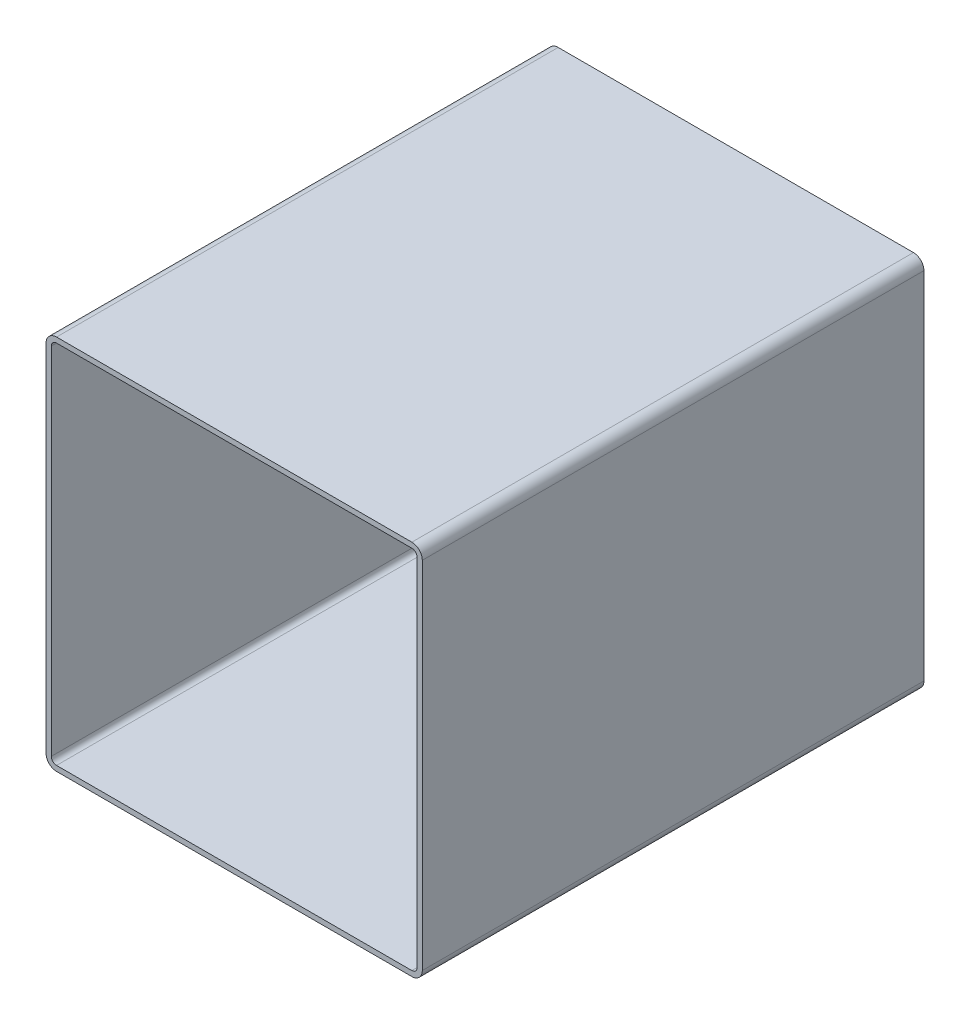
ISO-10303-21;
HEADER;
FILE_DESCRIPTION(('STEP AP214'),'2;1');
FILE_NAME('part.step','',(''),(''),'','','');
FILE_SCHEMA(('AUTOMOTIVE_DESIGN { 1 0 10303 214 1 1 1 1 }'));
ENDSEC;
DATA;
#1=APPLICATION_CONTEXT('core data for automotive mechanical design processes');
#2=APPLICATION_PROTOCOL_DEFINITION('international standard','automotive_design',2000,#1);
#3=PRODUCT_CONTEXT('',#1,'mechanical');
#4=PRODUCT('Part','Part','',(#3));
#5=PRODUCT_RELATED_PRODUCT_CATEGORY('part','',(#4));
#6=PRODUCT_DEFINITION_FORMATION('','',#4);
#7=PRODUCT_DEFINITION_CONTEXT('part definition',#1,'design');
#8=PRODUCT_DEFINITION('design','',#6,#7);
#9=PRODUCT_DEFINITION_SHAPE('','',#8);
#10=(LENGTH_UNIT() NAMED_UNIT(*) SI_UNIT(.MILLI.,.METRE.));
#11=(NAMED_UNIT(*) PLANE_ANGLE_UNIT() SI_UNIT($,.RADIAN.));
#12=(NAMED_UNIT(*) SI_UNIT($,.STERADIAN.) SOLID_ANGLE_UNIT());
#13=UNCERTAINTY_MEASURE_WITH_UNIT(LENGTH_MEASURE(1.E-05),#10,'distance_accuracy_value','');
#14=(GEOMETRIC_REPRESENTATION_CONTEXT(3) GLOBAL_UNCERTAINTY_ASSIGNED_CONTEXT((#13)) GLOBAL_UNIT_ASSIGNED_CONTEXT((#10,
#11,#12)) REPRESENTATION_CONTEXT('',''));
#15=CARTESIAN_POINT('',(0.,0.,0.));
#16=DIRECTION('',(0.,0.,1.));
#17=DIRECTION('',(1.,0.,0.));
#18=AXIS2_PLACEMENT_3D('',#15,#16,#17);
#19=CARTESIAN_POINT('',(6.92700219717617,224.193222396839,304.8));
#20=DIRECTION('',(0.,0.,1.));
#21=DIRECTION('',(1.,0.,0.));
#22=AXIS2_PLACEMENT_3D('',#19,#20,#21);
#23=PLANE('',#22);
#24=CARTESIAN_POINT('',(6.92700219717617,224.193222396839,304.8));
#25=DIRECTION('',(0.,0.,1.));
#26=DIRECTION('',(1.,0.,0.));
#27=AXIS2_PLACEMENT_3D('',#24,#25,#26);
#28=CIRCLE('',#27,6.35);
#29=CARTESIAN_POINT('',(6.92700219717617,230.543222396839,304.8));
#30=VERTEX_POINT('',#29);
#31=CARTESIAN_POINT('',(0.577002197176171,224.193222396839,304.8));
#32=VERTEX_POINT('',#31);
#33=EDGE_CURVE('E211',#30,#32,#28,.T.);
#34=ORIENTED_EDGE('',*,*,#33,.T.);
#35=DIRECTION('',(0.,-1.,0.));
#36=VECTOR('',#35,1.);
#37=CARTESIAN_POINT('',(0.577002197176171,8.29322239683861,304.8));
#38=LINE('',#37,#36);
#39=CARTESIAN_POINT('',(0.57700219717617,8.29322239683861,304.8));
#40=VERTEX_POINT('',#39);
#41=EDGE_CURVE('E214',#32,#40,#38,.T.);
#42=ORIENTED_EDGE('',*,*,#41,.T.);
#43=CARTESIAN_POINT('',(6.92700219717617,8.29322239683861,304.8));
#44=DIRECTION('',(0.,0.,1.));
#45=DIRECTION('',(1.,0.,0.));
#46=AXIS2_PLACEMENT_3D('',#43,#44,#45);
#47=CIRCLE('',#46,6.35);
#48=CARTESIAN_POINT('',(6.92700219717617,1.94322239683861,304.8));
#49=VERTEX_POINT('',#48);
#50=EDGE_CURVE('E217',#40,#49,#47,.T.);
#51=ORIENTED_EDGE('',*,*,#50,.T.);
#52=DIRECTION('',(1.,0.,0.));
#53=VECTOR('',#52,1.);
#54=CARTESIAN_POINT('',(222.827002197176,1.94322239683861,304.8));
#55=LINE('',#54,#53);
#56=CARTESIAN_POINT('',(222.827002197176,1.9432223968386,304.8));
#57=VERTEX_POINT('',#56);
#58=EDGE_CURVE('E219',#49,#57,#55,.T.);
#59=ORIENTED_EDGE('',*,*,#58,.T.);
#60=CARTESIAN_POINT('',(222.827002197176,8.29322239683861,304.8));
#61=DIRECTION('',(0.,0.,1.));
#62=DIRECTION('',(1.,0.,0.));
#63=AXIS2_PLACEMENT_3D('',#60,#61,#62);
#64=CIRCLE('',#63,6.35000000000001);
#65=CARTESIAN_POINT('',(229.177002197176,8.29322239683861,304.8));
#66=VERTEX_POINT('',#65);
#67=EDGE_CURVE('E221',#57,#66,#64,.T.);
#68=ORIENTED_EDGE('',*,*,#67,.T.);
#69=DIRECTION('',(0.,1.,0.));
#70=VECTOR('',#69,1.);
#71=CARTESIAN_POINT('',(229.177002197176,224.193222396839,304.8));
#72=LINE('',#71,#70);
#73=CARTESIAN_POINT('',(229.177002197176,224.193222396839,304.8));
#74=VERTEX_POINT('',#73);
#75=EDGE_CURVE('E223',#66,#74,#72,.T.);
#76=ORIENTED_EDGE('',*,*,#75,.T.);
#77=CARTESIAN_POINT('',(222.827002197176,224.193222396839,304.8));
#78=DIRECTION('',(0.,0.,1.));
#79=DIRECTION('',(1.,0.,0.));
#80=AXIS2_PLACEMENT_3D('',#77,#78,#79);
#81=CIRCLE('',#80,6.35000000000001);
#82=CARTESIAN_POINT('',(222.827002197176,230.543222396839,304.8));
#83=VERTEX_POINT('',#82);
#84=EDGE_CURVE('E225',#74,#83,#81,.T.);
#85=ORIENTED_EDGE('',*,*,#84,.T.);
#86=DIRECTION('',(-1.,0.,0.));
#87=VECTOR('',#86,1.);
#88=CARTESIAN_POINT('',(6.92700219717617,230.543222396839,304.8));
#89=LINE('',#88,#87);
#90=EDGE_CURVE('E227',#83,#30,#89,.T.);
#91=ORIENTED_EDGE('',*,*,#90,.T.);
#92=EDGE_LOOP('',(#34,#42,#51,#59,#68,#76,#85,#91));
#93=FACE_BOUND('',#92,.T.);
#94=DIRECTION('',(0.,-1.,0.));
#95=VECTOR('',#94,1.);
#96=CARTESIAN_POINT('',(3.75200219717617,8.29322239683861,304.8));
#97=LINE('',#96,#95);
#98=CARTESIAN_POINT('',(3.75200219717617,224.193222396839,304.8));
#99=VERTEX_POINT('',#98);
#100=CARTESIAN_POINT('',(3.75200219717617,8.29322239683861,304.8));
#101=VERTEX_POINT('',#100);
#102=EDGE_CURVE('E154',#99,#101,#97,.T.);
#103=ORIENTED_EDGE('',*,*,#102,.F.);
#104=CARTESIAN_POINT('',(6.92700219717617,224.193222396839,304.8));
#105=DIRECTION('',(0.,0.,1.));
#106=DIRECTION('',(1.,0.,0.));
#107=AXIS2_PLACEMENT_3D('',#104,#105,#106);
#108=CIRCLE('',#107,3.17500000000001);
#109=CARTESIAN_POINT('',(6.92700219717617,227.368222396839,304.8));
#110=VERTEX_POINT('',#109);
#111=EDGE_CURVE('E146',#110,#99,#108,.T.);
#112=ORIENTED_EDGE('',*,*,#111,.F.);
#113=DIRECTION('',(-1.,0.,0.));
#114=VECTOR('',#113,1.);
#115=CARTESIAN_POINT('',(6.92700219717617,227.368222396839,304.8));
#116=LINE('',#115,#114);
#117=CARTESIAN_POINT('',(222.827002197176,227.368222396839,304.8));
#118=VERTEX_POINT('',#117);
#119=EDGE_CURVE('E179',#118,#110,#116,.T.);
#120=ORIENTED_EDGE('',*,*,#119,.F.);
#121=CARTESIAN_POINT('',(222.827002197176,224.193222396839,304.8));
#122=DIRECTION('',(0.,0.,1.));
#123=DIRECTION('',(1.,0.,0.));
#124=AXIS2_PLACEMENT_3D('',#121,#122,#123);
#125=CIRCLE('',#124,3.17500000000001);
#126=CARTESIAN_POINT('',(226.002002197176,224.193222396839,304.8));
#127=VERTEX_POINT('',#126);
#128=EDGE_CURVE('E177',#127,#118,#125,.T.);
#129=ORIENTED_EDGE('',*,*,#128,.F.);
#130=DIRECTION('',(0.,1.,0.));
#131=VECTOR('',#130,1.);
#132=CARTESIAN_POINT('',(226.002002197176,224.193222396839,304.8));
#133=LINE('',#132,#131);
#134=CARTESIAN_POINT('',(226.002002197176,8.29322239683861,304.8));
#135=VERTEX_POINT('',#134);
#136=EDGE_CURVE('E175',#135,#127,#133,.T.);
#137=ORIENTED_EDGE('',*,*,#136,.F.);
#138=CARTESIAN_POINT('',(222.827002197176,8.29322239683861,304.8));
#139=DIRECTION('',(0.,0.,1.));
#140=DIRECTION('',(1.,0.,0.));
#141=AXIS2_PLACEMENT_3D('',#138,#139,#140);
#142=CIRCLE('',#141,3.17500000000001);
#143=CARTESIAN_POINT('',(222.827002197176,5.11822239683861,304.8));
#144=VERTEX_POINT('',#143);
#145=EDGE_CURVE('E173',#144,#135,#142,.T.);
#146=ORIENTED_EDGE('',*,*,#145,.F.);
#147=DIRECTION('',(1.,0.,0.));
#148=VECTOR('',#147,1.);
#149=CARTESIAN_POINT('',(222.827002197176,5.11822239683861,304.8));
#150=LINE('',#149,#148);
#151=CARTESIAN_POINT('',(6.92700219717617,5.11822239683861,304.8));
#152=VERTEX_POINT('',#151);
#153=EDGE_CURVE('E169',#152,#144,#150,.T.);
#154=ORIENTED_EDGE('',*,*,#153,.F.);
#155=CARTESIAN_POINT('',(6.92700219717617,8.29322239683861,304.8));
#156=DIRECTION('',(0.,0.,1.));
#157=DIRECTION('',(1.,0.,0.));
#158=AXIS2_PLACEMENT_3D('',#155,#156,#157);
#159=CIRCLE('',#158,3.175);
#160=EDGE_CURVE('E167',#101,#152,#159,.T.);
#161=ORIENTED_EDGE('',*,*,#160,.F.);
#162=EDGE_LOOP('',(#103,#112,#120,#129,#137,#146,#154,#161));
#163=FACE_BOUND('',#162,.T.);
#164=ADVANCED_FACE('F33',(#93,#163),#23,.T.);
#165=CARTESIAN_POINT('',(6.92700219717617,224.193222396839,0.));
#166=DIRECTION('',(0.,0.,1.));
#167=DIRECTION('',(1.,0.,0.));
#168=AXIS2_PLACEMENT_3D('',#165,#166,#167);
#169=PLANE('',#168);
#170=CARTESIAN_POINT('',(6.92700219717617,224.193222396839,0.));
#171=DIRECTION('',(0.,0.,1.));
#172=DIRECTION('',(1.,0.,0.));
#173=AXIS2_PLACEMENT_3D('',#170,#171,#172);
#174=CIRCLE('',#173,6.35);
#175=CARTESIAN_POINT('',(6.92700219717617,230.543222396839,0.));
#176=VERTEX_POINT('',#175);
#177=CARTESIAN_POINT('',(0.577002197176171,224.193222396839,0.));
#178=VERTEX_POINT('',#177);
#179=EDGE_CURVE('E162',#176,#178,#174,.T.);
#180=ORIENTED_EDGE('',*,*,#179,.F.);
#181=DIRECTION('',(-1.,0.,0.));
#182=VECTOR('',#181,1.);
#183=CARTESIAN_POINT('',(6.92700219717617,230.543222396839,0.));
#184=LINE('',#183,#182);
#185=CARTESIAN_POINT('',(222.827002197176,230.543222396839,0.));
#186=VERTEX_POINT('',#185);
#187=EDGE_CURVE('E215',#186,#176,#184,.T.);
#188=ORIENTED_EDGE('',*,*,#187,.F.);
#189=CARTESIAN_POINT('',(222.827002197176,224.193222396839,0.));
#190=DIRECTION('',(0.,0.,1.));
#191=DIRECTION('',(1.,0.,0.));
#192=AXIS2_PLACEMENT_3D('',#189,#190,#191);
#193=CIRCLE('',#192,6.35000000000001);
#194=CARTESIAN_POINT('',(229.177002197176,224.193222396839,0.));
#195=VERTEX_POINT('',#194);
#196=EDGE_CURVE('E242',#195,#186,#193,.T.);
#197=ORIENTED_EDGE('',*,*,#196,.F.);
#198=DIRECTION('',(0.,1.,0.));
#199=VECTOR('',#198,1.);
#200=CARTESIAN_POINT('',(229.177002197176,224.193222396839,0.));
#201=LINE('',#200,#199);
#202=CARTESIAN_POINT('',(229.177002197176,8.29322239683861,0.));
#203=VERTEX_POINT('',#202);
#204=EDGE_CURVE('E240',#203,#195,#201,.T.);
#205=ORIENTED_EDGE('',*,*,#204,.F.);
#206=CARTESIAN_POINT('',(222.827002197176,8.29322239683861,0.));
#207=DIRECTION('',(0.,0.,1.));
#208=DIRECTION('',(1.,0.,0.));
#209=AXIS2_PLACEMENT_3D('',#206,#207,#208);
#210=CIRCLE('',#209,6.35000000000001);
#211=CARTESIAN_POINT('',(222.827002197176,1.9432223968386,0.));
#212=VERTEX_POINT('',#211);
#213=EDGE_CURVE('E238',#212,#203,#210,.T.);
#214=ORIENTED_EDGE('',*,*,#213,.F.);
#215=DIRECTION('',(1.,0.,0.));
#216=VECTOR('',#215,1.);
#217=CARTESIAN_POINT('',(222.827002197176,1.94322239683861,0.));
#218=LINE('',#217,#216);
#219=CARTESIAN_POINT('',(6.92700219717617,1.94322239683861,0.));
#220=VERTEX_POINT('',#219);
#221=EDGE_CURVE('E236',#220,#212,#218,.T.);
#222=ORIENTED_EDGE('',*,*,#221,.F.);
#223=CARTESIAN_POINT('',(6.92700219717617,8.29322239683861,0.));
#224=DIRECTION('',(0.,0.,1.));
#225=DIRECTION('',(1.,0.,0.));
#226=AXIS2_PLACEMENT_3D('',#223,#224,#225);
#227=CIRCLE('',#226,6.35);
#228=CARTESIAN_POINT('',(0.57700219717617,8.29322239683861,0.));
#229=VERTEX_POINT('',#228);
#230=EDGE_CURVE('E234',#229,#220,#227,.T.);
#231=ORIENTED_EDGE('',*,*,#230,.F.);
#232=DIRECTION('',(0.,-1.,0.));
#233=VECTOR('',#232,1.);
#234=CARTESIAN_POINT('',(0.577002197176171,8.29322239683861,0.));
#235=LINE('',#234,#233);
#236=EDGE_CURVE('E232',#178,#229,#235,.T.);
#237=ORIENTED_EDGE('',*,*,#236,.F.);
#238=EDGE_LOOP('',(#180,#188,#197,#205,#214,#222,#231,#237));
#239=FACE_BOUND('',#238,.T.);
#240=CARTESIAN_POINT('',(6.92700219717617,224.193222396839,0.));
#241=DIRECTION('',(0.,0.,1.));
#242=DIRECTION('',(1.,0.,0.));
#243=AXIS2_PLACEMENT_3D('',#240,#241,#242);
#244=CIRCLE('',#243,3.17500000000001);
#245=CARTESIAN_POINT('',(6.92700219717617,227.368222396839,0.));
#246=VERTEX_POINT('',#245);
#247=CARTESIAN_POINT('',(3.75200219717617,224.193222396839,0.));
#248=VERTEX_POINT('',#247);
#249=EDGE_CURVE('E56',#246,#248,#244,.T.);
#250=ORIENTED_EDGE('',*,*,#249,.T.);
#251=DIRECTION('',(0.,-1.,0.));
#252=VECTOR('',#251,1.);
#253=CARTESIAN_POINT('',(3.75200219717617,8.29322239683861,0.));
#254=LINE('',#253,#252);
#255=CARTESIAN_POINT('',(3.75200219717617,8.29322239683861,0.));
#256=VERTEX_POINT('',#255);
#257=EDGE_CURVE('E161',#248,#256,#254,.T.);
#258=ORIENTED_EDGE('',*,*,#257,.T.);
#259=CARTESIAN_POINT('',(6.92700219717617,8.29322239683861,0.));
#260=DIRECTION('',(0.,0.,1.));
#261=DIRECTION('',(1.,0.,0.));
#262=AXIS2_PLACEMENT_3D('',#259,#260,#261);
#263=CIRCLE('',#262,3.175);
#264=CARTESIAN_POINT('',(6.92700219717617,5.11822239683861,0.));
#265=VERTEX_POINT('',#264);
#266=EDGE_CURVE('E183',#256,#265,#263,.T.);
#267=ORIENTED_EDGE('',*,*,#266,.T.);
#268=DIRECTION('',(1.,0.,0.));
#269=VECTOR('',#268,1.);
#270=CARTESIAN_POINT('',(222.827002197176,5.11822239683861,0.));
#271=LINE('',#270,#269);
#272=CARTESIAN_POINT('',(222.827002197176,5.11822239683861,0.));
#273=VERTEX_POINT('',#272);
#274=EDGE_CURVE('E186',#265,#273,#271,.T.);
#275=ORIENTED_EDGE('',*,*,#274,.T.);
#276=CARTESIAN_POINT('',(222.827002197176,8.29322239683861,0.));
#277=DIRECTION('',(0.,0.,1.));
#278=DIRECTION('',(1.,0.,0.));
#279=AXIS2_PLACEMENT_3D('',#276,#277,#278);
#280=CIRCLE('',#279,3.17500000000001);
#281=CARTESIAN_POINT('',(226.002002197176,8.29322239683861,0.));
#282=VERTEX_POINT('',#281);
#283=EDGE_CURVE('E189',#273,#282,#280,.T.);
#284=ORIENTED_EDGE('',*,*,#283,.T.);
#285=DIRECTION('',(0.,1.,0.));
#286=VECTOR('',#285,1.);
#287=CARTESIAN_POINT('',(226.002002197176,224.193222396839,0.));
#288=LINE('',#287,#286);
#289=CARTESIAN_POINT('',(226.002002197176,224.193222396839,0.));
#290=VERTEX_POINT('',#289);
#291=EDGE_CURVE('E192',#282,#290,#288,.T.);
#292=ORIENTED_EDGE('',*,*,#291,.T.);
#293=CARTESIAN_POINT('',(222.827002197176,224.193222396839,0.));
#294=DIRECTION('',(0.,0.,1.));
#295=DIRECTION('',(1.,0.,0.));
#296=AXIS2_PLACEMENT_3D('',#293,#294,#295);
#297=CIRCLE('',#296,3.17500000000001);
#298=CARTESIAN_POINT('',(222.827002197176,227.368222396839,0.));
#299=VERTEX_POINT('',#298);
#300=EDGE_CURVE('E195',#290,#299,#297,.T.);
#301=ORIENTED_EDGE('',*,*,#300,.T.);
#302=DIRECTION('',(-1.,0.,0.));
#303=VECTOR('',#302,1.);
#304=CARTESIAN_POINT('',(6.92700219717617,227.368222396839,0.));
#305=LINE('',#304,#303);
#306=EDGE_CURVE('E155',#299,#246,#305,.T.);
#307=ORIENTED_EDGE('',*,*,#306,.T.);
#308=EDGE_LOOP('',(#250,#258,#267,#275,#284,#292,#301,#307));
#309=FACE_BOUND('',#308,.T.);
#310=ADVANCED_FACE('F272',(#239,#309),#169,.F.);
#311=CARTESIAN_POINT('',(6.92700219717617,224.193222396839,304.8));
#312=DIRECTION('',(0.,0.,-1.));
#313=DIRECTION('',(-1.,0.,0.));
#314=AXIS2_PLACEMENT_3D('',#311,#312,#313);
#315=CYLINDRICAL_SURFACE('',#314,6.35);
#316=ORIENTED_EDGE('',*,*,#179,.T.);
#317=DIRECTION('',(0.,0.,-1.));
#318=VECTOR('',#317,1.);
#319=CARTESIAN_POINT('',(0.577002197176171,224.193222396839,304.8));
#320=LINE('',#319,#318);
#321=EDGE_CURVE('E11',#32,#178,#320,.T.);
#322=ORIENTED_EDGE('',*,*,#321,.F.);
#323=ORIENTED_EDGE('',*,*,#33,.F.);
#324=DIRECTION('',(0.,0.,-1.));
#325=VECTOR('',#324,1.);
#326=CARTESIAN_POINT('',(6.92700219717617,230.543222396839,304.8));
#327=LINE('',#326,#325);
#328=EDGE_CURVE('E229',#30,#176,#327,.T.);
#329=ORIENTED_EDGE('',*,*,#328,.T.);
#330=EDGE_LOOP('',(#316,#322,#323,#329));
#331=FACE_BOUND('',#330,.T.);
#332=ADVANCED_FACE('F35',(#331),#315,.T.);
#333=CARTESIAN_POINT('',(0.577002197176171,8.29322239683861,304.8));
#334=DIRECTION('',(1.,0.,0.));
#335=DIRECTION('',(0.,0.,-1.));
#336=AXIS2_PLACEMENT_3D('',#333,#334,#335);
#337=PLANE('',#336);
#338=ORIENTED_EDGE('',*,*,#236,.T.);
#339=DIRECTION('',(0.,0.,-1.));
#340=VECTOR('',#339,1.);
#341=CARTESIAN_POINT('',(0.57700219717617,8.29322239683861,304.8));
#342=LINE('',#341,#340);
#343=EDGE_CURVE('E41',#40,#229,#342,.T.);
#344=ORIENTED_EDGE('',*,*,#343,.F.);
#345=ORIENTED_EDGE('',*,*,#41,.F.);
#346=ORIENTED_EDGE('',*,*,#321,.T.);
#347=EDGE_LOOP('',(#338,#344,#345,#346));
#348=FACE_BOUND('',#347,.T.);
#349=ADVANCED_FACE('F289',(#348),#337,.F.);
#350=CARTESIAN_POINT('',(6.92700219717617,8.29322239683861,304.8));
#351=DIRECTION('',(0.,0.,-1.));
#352=DIRECTION('',(-1.,0.,0.));
#353=AXIS2_PLACEMENT_3D('',#350,#351,#352);
#354=CYLINDRICAL_SURFACE('',#353,6.35);
#355=ORIENTED_EDGE('',*,*,#230,.T.);
#356=DIRECTION('',(0.,0.,-1.));
#357=VECTOR('',#356,1.);
#358=CARTESIAN_POINT('',(6.92700219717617,1.94322239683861,304.8));
#359=LINE('',#358,#357);
#360=EDGE_CURVE('E259',#49,#220,#359,.T.);
#361=ORIENTED_EDGE('',*,*,#360,.F.);
#362=ORIENTED_EDGE('',*,*,#50,.F.);
#363=ORIENTED_EDGE('',*,*,#343,.T.);
#364=EDGE_LOOP('',(#355,#361,#362,#363));
#365=FACE_BOUND('',#364,.T.);
#366=ADVANCED_FACE('F266',(#365),#354,.T.);
#367=CARTESIAN_POINT('',(222.827002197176,1.94322239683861,304.8));
#368=DIRECTION('',(0.,1.,0.));
#369=DIRECTION('',(0.,0.,1.));
#370=AXIS2_PLACEMENT_3D('',#367,#368,#369);
#371=PLANE('',#370);
#372=ORIENTED_EDGE('',*,*,#221,.T.);
#373=DIRECTION('',(0.,0.,-1.));
#374=VECTOR('',#373,1.);
#375=CARTESIAN_POINT('',(222.827002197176,1.9432223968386,304.8));
#376=LINE('',#375,#374);
#377=EDGE_CURVE('E256',#57,#212,#376,.T.);
#378=ORIENTED_EDGE('',*,*,#377,.F.);
#379=ORIENTED_EDGE('',*,*,#58,.F.);
#380=ORIENTED_EDGE('',*,*,#360,.T.);
#381=EDGE_LOOP('',(#372,#378,#379,#380));
#382=FACE_BOUND('',#381,.T.);
#383=ADVANCED_FACE('F278',(#382),#371,.F.);
#384=CARTESIAN_POINT('',(222.827002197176,8.29322239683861,304.8));
#385=DIRECTION('',(0.,0.,-1.));
#386=DIRECTION('',(-1.,0.,0.));
#387=AXIS2_PLACEMENT_3D('',#384,#385,#386);
#388=CYLINDRICAL_SURFACE('',#387,6.35000000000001);
#389=ORIENTED_EDGE('',*,*,#213,.T.);
#390=DIRECTION('',(0.,0.,-1.));
#391=VECTOR('',#390,1.);
#392=CARTESIAN_POINT('',(229.177002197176,8.29322239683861,304.8));
#393=LINE('',#392,#391);
#394=EDGE_CURVE('E253',#66,#203,#393,.T.);
#395=ORIENTED_EDGE('',*,*,#394,.F.);
#396=ORIENTED_EDGE('',*,*,#67,.F.);
#397=ORIENTED_EDGE('',*,*,#377,.T.);
#398=EDGE_LOOP('',(#389,#395,#396,#397));
#399=FACE_BOUND('',#398,.T.);
#400=ADVANCED_FACE('F282',(#399),#388,.T.);
#401=CARTESIAN_POINT('',(229.177002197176,224.193222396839,304.8));
#402=DIRECTION('',(-1.,0.,0.));
#403=DIRECTION('',(0.,0.,1.));
#404=AXIS2_PLACEMENT_3D('',#401,#402,#403);
#405=PLANE('',#404);
#406=ORIENTED_EDGE('',*,*,#204,.T.);
#407=DIRECTION('',(0.,0.,-1.));
#408=VECTOR('',#407,1.);
#409=CARTESIAN_POINT('',(229.177002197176,224.193222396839,304.8));
#410=LINE('',#409,#408);
#411=EDGE_CURVE('E250',#74,#195,#410,.T.);
#412=ORIENTED_EDGE('',*,*,#411,.F.);
#413=ORIENTED_EDGE('',*,*,#75,.F.);
#414=ORIENTED_EDGE('',*,*,#394,.T.);
#415=EDGE_LOOP('',(#406,#412,#413,#414));
#416=FACE_BOUND('',#415,.T.);
#417=ADVANCED_FACE('F302',(#416),#405,.F.);
#418=CARTESIAN_POINT('',(222.827002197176,224.193222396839,304.8));
#419=DIRECTION('',(0.,0.,-1.));
#420=DIRECTION('',(-1.,0.,0.));
#421=AXIS2_PLACEMENT_3D('',#418,#419,#420);
#422=CYLINDRICAL_SURFACE('',#421,6.35000000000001);
#423=ORIENTED_EDGE('',*,*,#196,.T.);
#424=DIRECTION('',(0.,0.,-1.));
#425=VECTOR('',#424,1.);
#426=CARTESIAN_POINT('',(222.827002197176,230.543222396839,304.8));
#427=LINE('',#426,#425);
#428=EDGE_CURVE('E247',#83,#186,#427,.T.);
#429=ORIENTED_EDGE('',*,*,#428,.F.);
#430=ORIENTED_EDGE('',*,*,#84,.F.);
#431=ORIENTED_EDGE('',*,*,#411,.T.);
#432=EDGE_LOOP('',(#423,#429,#430,#431));
#433=FACE_BOUND('',#432,.T.);
#434=ADVANCED_FACE('F300',(#433),#422,.T.);
#435=CARTESIAN_POINT('',(6.92700219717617,230.543222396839,304.8));
#436=DIRECTION('',(0.,-1.,0.));
#437=DIRECTION('',(0.,0.,-1.));
#438=AXIS2_PLACEMENT_3D('',#435,#436,#437);
#439=PLANE('',#438);
#440=ORIENTED_EDGE('',*,*,#187,.T.);
#441=ORIENTED_EDGE('',*,*,#328,.F.);
#442=ORIENTED_EDGE('',*,*,#90,.F.);
#443=ORIENTED_EDGE('',*,*,#428,.T.);
#444=EDGE_LOOP('',(#440,#441,#442,#443));
#445=FACE_BOUND('',#444,.T.);
#446=ADVANCED_FACE('F295',(#445),#439,.F.);
#447=CARTESIAN_POINT('',(6.92700219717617,224.193222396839,304.8));
#448=DIRECTION('',(0.,0.,-1.));
#449=DIRECTION('',(-1.,0.,0.));
#450=AXIS2_PLACEMENT_3D('',#447,#448,#449);
#451=CYLINDRICAL_SURFACE('',#450,3.17500000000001);
#452=ORIENTED_EDGE('',*,*,#249,.F.);
#453=DIRECTION('',(0.,0.,-1.));
#454=VECTOR('',#453,1.);
#455=CARTESIAN_POINT('',(6.92700219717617,227.368222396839,304.8));
#456=LINE('',#455,#454);
#457=EDGE_CURVE('E150',#110,#246,#456,.T.);
#458=ORIENTED_EDGE('',*,*,#457,.F.);
#459=ORIENTED_EDGE('',*,*,#111,.T.);
#460=DIRECTION('',(0.,0.,-1.));
#461=VECTOR('',#460,1.);
#462=CARTESIAN_POINT('',(3.75200219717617,224.193222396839,304.8));
#463=LINE('',#462,#461);
#464=EDGE_CURVE('E149',#99,#248,#463,.T.);
#465=ORIENTED_EDGE('',*,*,#464,.T.);
#466=EDGE_LOOP('',(#452,#458,#459,#465));
#467=FACE_BOUND('',#466,.T.);
#468=ADVANCED_FACE('F148',(#467),#451,.F.);
#469=CARTESIAN_POINT('',(3.75200219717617,8.29322239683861,304.8));
#470=DIRECTION('',(1.,0.,0.));
#471=DIRECTION('',(0.,0.,-1.));
#472=AXIS2_PLACEMENT_3D('',#469,#470,#471);
#473=PLANE('',#472);
#474=ORIENTED_EDGE('',*,*,#257,.F.);
#475=ORIENTED_EDGE('',*,*,#464,.F.);
#476=ORIENTED_EDGE('',*,*,#102,.T.);
#477=DIRECTION('',(0.,0.,-1.));
#478=VECTOR('',#477,1.);
#479=CARTESIAN_POINT('',(3.75200219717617,8.29322239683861,304.8));
#480=LINE('',#479,#478);
#481=EDGE_CURVE('E163',#101,#256,#480,.T.);
#482=ORIENTED_EDGE('',*,*,#481,.T.);
#483=EDGE_LOOP('',(#474,#475,#476,#482));
#484=FACE_BOUND('',#483,.T.);
#485=ADVANCED_FACE('F158',(#484),#473,.T.);
#486=CARTESIAN_POINT('',(6.92700219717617,8.29322239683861,304.8));
#487=DIRECTION('',(0.,0.,-1.));
#488=DIRECTION('',(-1.,0.,0.));
#489=AXIS2_PLACEMENT_3D('',#486,#487,#488);
#490=CYLINDRICAL_SURFACE('',#489,3.175);
#491=ORIENTED_EDGE('',*,*,#266,.F.);
#492=ORIENTED_EDGE('',*,*,#481,.F.);
#493=ORIENTED_EDGE('',*,*,#160,.T.);
#494=DIRECTION('',(0.,0.,-1.));
#495=VECTOR('',#494,1.);
#496=CARTESIAN_POINT('',(6.92700219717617,5.11822239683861,304.8));
#497=LINE('',#496,#495);
#498=EDGE_CURVE('E208',#152,#265,#497,.T.);
#499=ORIENTED_EDGE('',*,*,#498,.T.);
#500=EDGE_LOOP('',(#491,#492,#493,#499));
#501=FACE_BOUND('',#500,.T.);
#502=ADVANCED_FACE('F327',(#501),#490,.F.);
#503=CARTESIAN_POINT('',(222.827002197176,5.11822239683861,304.8));
#504=DIRECTION('',(0.,1.,0.));
#505=DIRECTION('',(0.,0.,1.));
#506=AXIS2_PLACEMENT_3D('',#503,#504,#505);
#507=PLANE('',#506);
#508=ORIENTED_EDGE('',*,*,#274,.F.);
#509=ORIENTED_EDGE('',*,*,#498,.F.);
#510=ORIENTED_EDGE('',*,*,#153,.T.);
#511=DIRECTION('',(0.,0.,-1.));
#512=VECTOR('',#511,1.);
#513=CARTESIAN_POINT('',(222.827002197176,5.11822239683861,304.8));
#514=LINE('',#513,#512);
#515=EDGE_CURVE('E206',#144,#273,#514,.T.);
#516=ORIENTED_EDGE('',*,*,#515,.T.);
#517=EDGE_LOOP('',(#508,#509,#510,#516));
#518=FACE_BOUND('',#517,.T.);
#519=ADVANCED_FACE('F331',(#518),#507,.T.);
#520=CARTESIAN_POINT('',(222.827002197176,8.29322239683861,304.8));
#521=DIRECTION('',(0.,0.,-1.));
#522=DIRECTION('',(-1.,0.,0.));
#523=AXIS2_PLACEMENT_3D('',#520,#521,#522);
#524=CYLINDRICAL_SURFACE('',#523,3.17500000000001);
#525=ORIENTED_EDGE('',*,*,#283,.F.);
#526=ORIENTED_EDGE('',*,*,#515,.F.);
#527=ORIENTED_EDGE('',*,*,#145,.T.);
#528=DIRECTION('',(0.,0.,-1.));
#529=VECTOR('',#528,1.);
#530=CARTESIAN_POINT('',(226.002002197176,8.29322239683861,304.8));
#531=LINE('',#530,#529);
#532=EDGE_CURVE('E204',#135,#282,#531,.T.);
#533=ORIENTED_EDGE('',*,*,#532,.T.);
#534=EDGE_LOOP('',(#525,#526,#527,#533));
#535=FACE_BOUND('',#534,.T.);
#536=ADVANCED_FACE('F337',(#535),#524,.F.);
#537=CARTESIAN_POINT('',(226.002002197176,224.193222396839,304.8));
#538=DIRECTION('',(-1.,0.,0.));
#539=DIRECTION('',(0.,0.,1.));
#540=AXIS2_PLACEMENT_3D('',#537,#538,#539);
#541=PLANE('',#540);
#542=ORIENTED_EDGE('',*,*,#291,.F.);
#543=ORIENTED_EDGE('',*,*,#532,.F.);
#544=ORIENTED_EDGE('',*,*,#136,.T.);
#545=DIRECTION('',(0.,0.,-1.));
#546=VECTOR('',#545,1.);
#547=CARTESIAN_POINT('',(226.002002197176,224.193222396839,304.8));
#548=LINE('',#547,#546);
#549=EDGE_CURVE('E202',#127,#290,#548,.T.);
#550=ORIENTED_EDGE('',*,*,#549,.T.);
#551=EDGE_LOOP('',(#542,#543,#544,#550));
#552=FACE_BOUND('',#551,.T.);
#553=ADVANCED_FACE('F341',(#552),#541,.T.);
#554=CARTESIAN_POINT('',(222.827002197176,224.193222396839,304.8));
#555=DIRECTION('',(0.,0.,-1.));
#556=DIRECTION('',(-1.,0.,0.));
#557=AXIS2_PLACEMENT_3D('',#554,#555,#556);
#558=CYLINDRICAL_SURFACE('',#557,3.17500000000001);
#559=ORIENTED_EDGE('',*,*,#300,.F.);
#560=ORIENTED_EDGE('',*,*,#549,.F.);
#561=ORIENTED_EDGE('',*,*,#128,.T.);
#562=DIRECTION('',(0.,0.,-1.));
#563=VECTOR('',#562,1.);
#564=CARTESIAN_POINT('',(222.827002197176,227.368222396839,304.8));
#565=LINE('',#564,#563);
#566=EDGE_CURVE('E48',#118,#299,#565,.T.);
#567=ORIENTED_EDGE('',*,*,#566,.T.);
#568=EDGE_LOOP('',(#559,#560,#561,#567));
#569=FACE_BOUND('',#568,.T.);
#570=ADVANCED_FACE('F345',(#569),#558,.F.);
#571=CARTESIAN_POINT('',(6.92700219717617,227.368222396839,304.8));
#572=DIRECTION('',(0.,-1.,0.));
#573=DIRECTION('',(0.,0.,-1.));
#574=AXIS2_PLACEMENT_3D('',#571,#572,#573);
#575=PLANE('',#574);
#576=ORIENTED_EDGE('',*,*,#306,.F.);
#577=ORIENTED_EDGE('',*,*,#566,.F.);
#578=ORIENTED_EDGE('',*,*,#119,.T.);
#579=ORIENTED_EDGE('',*,*,#457,.T.);
#580=EDGE_LOOP('',(#576,#577,#578,#579));
#581=FACE_BOUND('',#580,.T.);
#582=ADVANCED_FACE('F349',(#581),#575,.T.);
#583=CLOSED_SHELL('',(#164,#310,#332,#349,#366,#383,#400,#417,#434,#446,#468,#485,#502,#519,
#536,#553,#570,#582));
#584=MANIFOLD_SOLID_BREP('B2',#583);
#585=ADVANCED_BREP_SHAPE_REPRESENTATION('',(#18,#584),#14);
#586=SHAPE_DEFINITION_REPRESENTATION(#9,#585);
ENDSEC;
END-ISO-10303-21;
